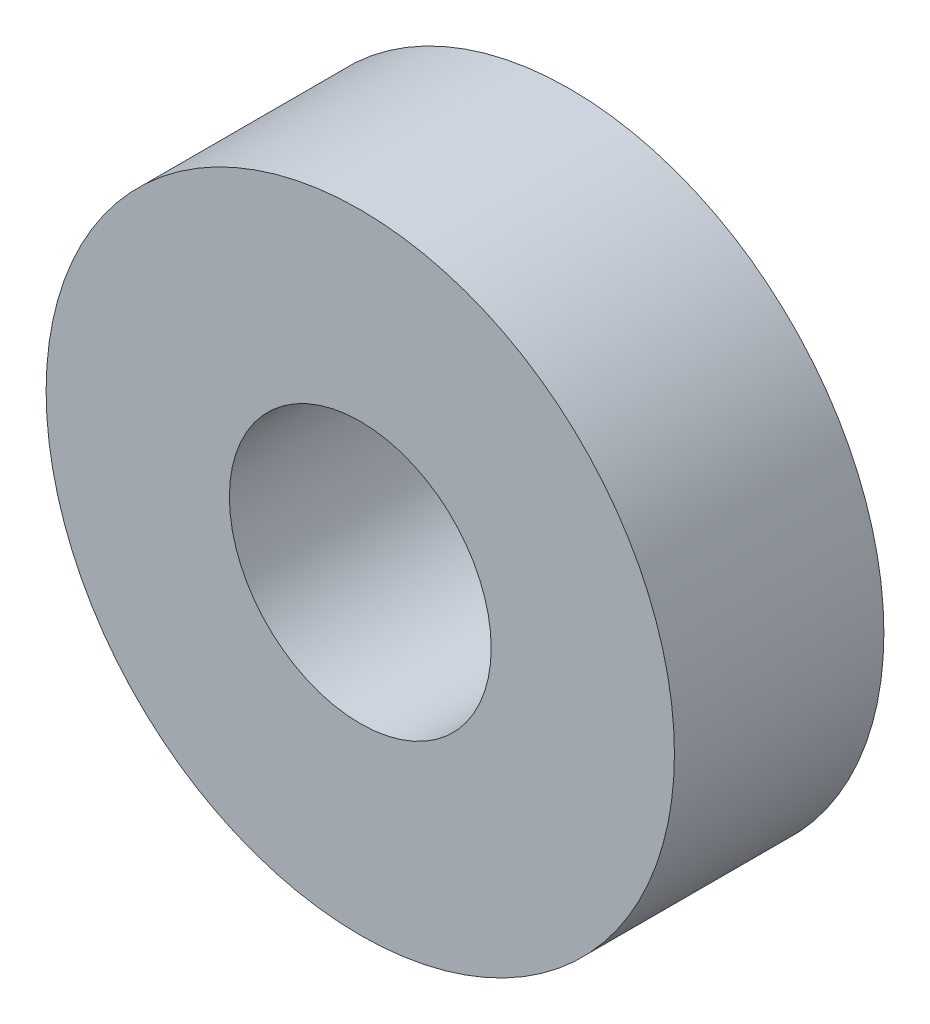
ISO-10303-21;
HEADER;
FILE_DESCRIPTION(('STEP AP214'),'2;1');
FILE_NAME('part.step','',(''),(''),'','','');
FILE_SCHEMA(('AUTOMOTIVE_DESIGN { 1 0 10303 214 1 1 1 1 }'));
ENDSEC;
DATA;
#1=APPLICATION_CONTEXT('core data for automotive mechanical design processes');
#2=APPLICATION_PROTOCOL_DEFINITION('international standard','automotive_design',2000,#1);
#3=PRODUCT_CONTEXT('',#1,'mechanical');
#4=PRODUCT('Part','Part','',(#3));
#5=PRODUCT_RELATED_PRODUCT_CATEGORY('part','',(#4));
#6=PRODUCT_DEFINITION_FORMATION('','',#4);
#7=PRODUCT_DEFINITION_CONTEXT('part definition',#1,'design');
#8=PRODUCT_DEFINITION('design','',#6,#7);
#9=PRODUCT_DEFINITION_SHAPE('','',#8);
#10=(LENGTH_UNIT() NAMED_UNIT(*) SI_UNIT(.MILLI.,.METRE.));
#11=(NAMED_UNIT(*) PLANE_ANGLE_UNIT() SI_UNIT($,.RADIAN.));
#12=(NAMED_UNIT(*) SI_UNIT($,.STERADIAN.) SOLID_ANGLE_UNIT());
#13=UNCERTAINTY_MEASURE_WITH_UNIT(LENGTH_MEASURE(1.E-05),#10,'distance_accuracy_value','');
#14=(GEOMETRIC_REPRESENTATION_CONTEXT(3) GLOBAL_UNCERTAINTY_ASSIGNED_CONTEXT((#13)) GLOBAL_UNIT_ASSIGNED_CONTEXT((#10,
#11,#12)) REPRESENTATION_CONTEXT('',''));
#15=CARTESIAN_POINT('',(0.,0.,0.));
#16=DIRECTION('',(0.,0.,1.));
#17=DIRECTION('',(1.,0.,0.));
#18=AXIS2_PLACEMENT_3D('',#15,#16,#17);
#19=CARTESIAN_POINT('',(0.,0.,0.));
#20=DIRECTION('',(0.,0.,-1.));
#21=DIRECTION('',(-1.,0.,0.));
#22=AXIS2_PLACEMENT_3D('',#19,#20,#21);
#23=PLANE('',#22);
#24=CARTESIAN_POINT('',(0.,0.,0.));
#25=DIRECTION('',(0.,0.,-1.));
#26=DIRECTION('',(1.,0.,0.));
#27=AXIS2_PLACEMENT_3D('',#24,#25,#26);
#28=CIRCLE('',#27,12.);
#29=CARTESIAN_POINT('',(12.,0.,0.));
#30=VERTEX_POINT('',#29);
#31=EDGE_CURVE('E26',#30,#30,#28,.T.);
#32=ORIENTED_EDGE('',*,*,#31,.T.);
#33=EDGE_LOOP('',(#32));
#34=FACE_BOUND('',#33,.T.);
#35=CARTESIAN_POINT('',(0.,0.,0.));
#36=DIRECTION('',(0.,0.,-1.));
#37=DIRECTION('',(1.,0.,0.));
#38=AXIS2_PLACEMENT_3D('',#35,#36,#37);
#39=CIRCLE('',#38,8.);
#40=CARTESIAN_POINT('',(8.00000000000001,0.,0.));
#41=VERTEX_POINT('',#40);
#42=EDGE_CURVE('E39',#41,#41,#39,.T.);
#43=ORIENTED_EDGE('',*,*,#42,.F.);
#44=EDGE_LOOP('',(#43));
#45=FACE_BOUND('',#44,.T.);
#46=ADVANCED_FACE('F15',(#34,#45),#23,.T.);
#47=CARTESIAN_POINT('',(0.,0.,8.));
#48=DIRECTION('',(0.,0.,-1.));
#49=DIRECTION('',(-1.,0.,0.));
#50=AXIS2_PLACEMENT_3D('',#47,#48,#49);
#51=CYLINDRICAL_SURFACE('',#50,5.);
#52=CARTESIAN_POINT('',(0.,0.,8.));
#53=DIRECTION('',(0.,0.,-1.));
#54=DIRECTION('',(1.,0.,0.));
#55=AXIS2_PLACEMENT_3D('',#52,#53,#54);
#56=CIRCLE('',#55,5.);
#57=CARTESIAN_POINT('',(5.00000000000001,0.,8.));
#58=VERTEX_POINT('',#57);
#59=EDGE_CURVE('E10',#58,#58,#56,.T.);
#60=ORIENTED_EDGE('',*,*,#59,.F.);
#61=EDGE_LOOP('',(#60));
#62=FACE_BOUND('',#61,.T.);
#63=CARTESIAN_POINT('',(0.,0.,-2.));
#64=DIRECTION('',(0.,0.,-1.));
#65=DIRECTION('',(1.,0.,0.));
#66=AXIS2_PLACEMENT_3D('',#63,#64,#65);
#67=CIRCLE('',#66,5.);
#68=CARTESIAN_POINT('',(5.00000000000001,0.,-2.));
#69=VERTEX_POINT('',#68);
#70=EDGE_CURVE('E31',#69,#69,#67,.T.);
#71=ORIENTED_EDGE('',*,*,#70,.T.);
#72=EDGE_LOOP('',(#71));
#73=FACE_BOUND('',#72,.T.);
#74=ADVANCED_FACE('F49',(#62,#73),#51,.F.);
#75=CARTESIAN_POINT('',(0.,0.,8.));
#76=DIRECTION('',(0.,0.,-1.));
#77=DIRECTION('',(-1.,0.,0.));
#78=AXIS2_PLACEMENT_3D('',#75,#76,#77);
#79=CYLINDRICAL_SURFACE('',#78,12.);
#80=CARTESIAN_POINT('',(0.,0.,8.));
#81=DIRECTION('',(0.,0.,-1.));
#82=DIRECTION('',(1.,0.,0.));
#83=AXIS2_PLACEMENT_3D('',#80,#81,#82);
#84=CIRCLE('',#83,12.);
#85=CARTESIAN_POINT('',(12.,0.,8.));
#86=VERTEX_POINT('',#85);
#87=EDGE_CURVE('E22',#86,#86,#84,.T.);
#88=ORIENTED_EDGE('',*,*,#87,.T.);
#89=EDGE_LOOP('',(#88));
#90=FACE_BOUND('',#89,.T.);
#91=ORIENTED_EDGE('',*,*,#31,.F.);
#92=EDGE_LOOP('',(#91));
#93=FACE_BOUND('',#92,.T.);
#94=ADVANCED_FACE('F17',(#90,#93),#79,.T.);
#95=CARTESIAN_POINT('',(0.,0.,8.));
#96=DIRECTION('',(0.,0.,-1.));
#97=DIRECTION('',(-1.,0.,0.));
#98=AXIS2_PLACEMENT_3D('',#95,#96,#97);
#99=PLANE('',#98);
#100=ORIENTED_EDGE('',*,*,#59,.T.);
#101=EDGE_LOOP('',(#100));
#102=FACE_BOUND('',#101,.T.);
#103=ORIENTED_EDGE('',*,*,#87,.F.);
#104=EDGE_LOOP('',(#103));
#105=FACE_BOUND('',#104,.T.);
#106=ADVANCED_FACE('F60',(#102,#105),#99,.F.);
#107=CARTESIAN_POINT('',(0.,0.,-2.));
#108=DIRECTION('',(0.,0.,1.));
#109=DIRECTION('',(1.,0.,0.));
#110=AXIS2_PLACEMENT_3D('',#107,#108,#109);
#111=CYLINDRICAL_SURFACE('',#110,8.);
#112=CARTESIAN_POINT('',(0.,0.,-2.));
#113=DIRECTION('',(0.,0.,-1.));
#114=DIRECTION('',(1.,0.,0.));
#115=AXIS2_PLACEMENT_3D('',#112,#113,#114);
#116=CIRCLE('',#115,8.);
#117=CARTESIAN_POINT('',(8.00000000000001,0.,-2.));
#118=VERTEX_POINT('',#117);
#119=EDGE_CURVE('E36',#118,#118,#116,.T.);
#120=ORIENTED_EDGE('',*,*,#119,.F.);
#121=EDGE_LOOP('',(#120));
#122=FACE_BOUND('',#121,.T.);
#123=ORIENTED_EDGE('',*,*,#42,.T.);
#124=EDGE_LOOP('',(#123));
#125=FACE_BOUND('',#124,.T.);
#126=ADVANCED_FACE('F46',(#122,#125),#111,.T.);
#127=CARTESIAN_POINT('',(0.,0.,-2.));
#128=DIRECTION('',(0.,0.,-1.));
#129=DIRECTION('',(-1.,0.,0.));
#130=AXIS2_PLACEMENT_3D('',#127,#128,#129);
#131=PLANE('',#130);
#132=ORIENTED_EDGE('',*,*,#70,.F.);
#133=EDGE_LOOP('',(#132));
#134=FACE_BOUND('',#133,.T.);
#135=ORIENTED_EDGE('',*,*,#119,.T.);
#136=EDGE_LOOP('',(#135));
#137=FACE_BOUND('',#136,.T.);
#138=ADVANCED_FACE('F66',(#134,#137),#131,.T.);
#139=CLOSED_SHELL('',(#46,#74,#94,#106,#126,#138));
#140=MANIFOLD_SOLID_BREP('B1',#139);
#141=ADVANCED_BREP_SHAPE_REPRESENTATION('',(#18,#140),#14);
#142=SHAPE_DEFINITION_REPRESENTATION(#9,#141);
ENDSEC;
END-ISO-10303-21;
